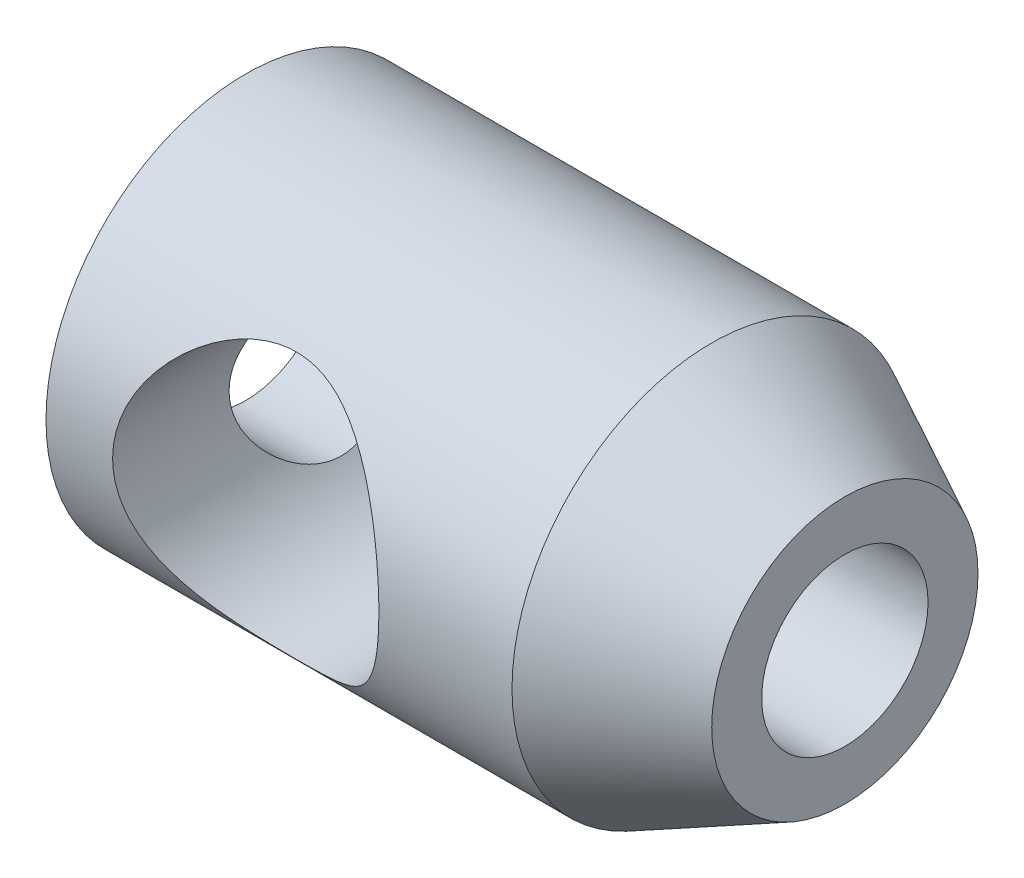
ISO-10303-21;
HEADER;
FILE_DESCRIPTION(('STEP AP214'),'2;1');
FILE_NAME('part.step','',(''),(''),'','','');
FILE_SCHEMA(('AUTOMOTIVE_DESIGN { 1 0 10303 214 1 1 1 1 }'));
ENDSEC;
DATA;
#1=APPLICATION_CONTEXT('core data for automotive mechanical design processes');
#2=APPLICATION_PROTOCOL_DEFINITION('international standard','automotive_design',2000,#1);
#3=PRODUCT_CONTEXT('',#1,'mechanical');
#4=PRODUCT('Part','Part','',(#3));
#5=PRODUCT_RELATED_PRODUCT_CATEGORY('part','',(#4));
#6=PRODUCT_DEFINITION_FORMATION('','',#4);
#7=PRODUCT_DEFINITION_CONTEXT('part definition',#1,'design');
#8=PRODUCT_DEFINITION('design','',#6,#7);
#9=PRODUCT_DEFINITION_SHAPE('','',#8);
#10=(LENGTH_UNIT() NAMED_UNIT(*) SI_UNIT(.MILLI.,.METRE.));
#11=(NAMED_UNIT(*) PLANE_ANGLE_UNIT() SI_UNIT($,.RADIAN.));
#12=(NAMED_UNIT(*) SI_UNIT($,.STERADIAN.) SOLID_ANGLE_UNIT());
#13=UNCERTAINTY_MEASURE_WITH_UNIT(LENGTH_MEASURE(1.E-05),#10,'distance_accuracy_value','');
#14=(GEOMETRIC_REPRESENTATION_CONTEXT(3) GLOBAL_UNCERTAINTY_ASSIGNED_CONTEXT((#13)) GLOBAL_UNIT_ASSIGNED_CONTEXT((#10,
#11,#12)) REPRESENTATION_CONTEXT('',''));
#15=CARTESIAN_POINT('',(0.,0.,0.));
#16=DIRECTION('',(0.,0.,1.));
#17=DIRECTION('',(1.,0.,0.));
#18=AXIS2_PLACEMENT_3D('',#15,#16,#17);
#19=CARTESIAN_POINT('',(18.,0.,0.));
#20=DIRECTION('',(1.,0.,0.));
#21=DIRECTION('',(0.,0.,-1.));
#22=AXIS2_PLACEMENT_3D('',#19,#20,#21);
#23=CYLINDRICAL_SURFACE('',#22,2.49999999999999);
#24=CARTESIAN_POINT('',(2.,0.,-2.49999999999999));
#25=CARTESIAN_POINT('',(2.00000958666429,0.12701747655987,-2.49998952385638));
#26=CARTESIAN_POINT('',(2.0061139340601,0.254191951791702,-2.49025350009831));
#27=CARTESIAN_POINT('',(2.02995624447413,0.504637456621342,-2.45182887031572));
#28=CARTESIAN_POINT('',(2.04771638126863,0.627900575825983,-2.42310413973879));
#29=CARTESIAN_POINT('',(2.09308304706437,0.866410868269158,-2.34837714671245));
#30=CARTESIAN_POINT('',(2.12064081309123,0.981694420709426,-2.30246039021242));
#31=CARTESIAN_POINT('',(2.18330800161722,1.20252080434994,-2.19522833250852));
#32=CARTESIAN_POINT('',(2.2184165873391,1.30806471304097,-2.13391473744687));
#33=CARTESIAN_POINT('',(2.29659695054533,1.51594836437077,-1.9922268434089));
#34=CARTESIAN_POINT('',(2.34008075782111,1.6173591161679,-1.91072139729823));
#35=CARTESIAN_POINT('',(2.42937299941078,1.80597275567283,-1.73356165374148));
#36=CARTESIAN_POINT('',(2.47518450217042,1.89315621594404,-1.63788834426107));
#37=CARTESIAN_POINT('',(2.57139162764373,2.0628574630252,-1.41993221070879));
#38=CARTESIAN_POINT('',(2.62156778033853,2.14314412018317,-1.29580042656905));
#39=CARTESIAN_POINT('',(2.71339603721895,2.28147932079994,-1.03287036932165));
#40=CARTESIAN_POINT('',(2.75506247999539,2.33956541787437,-0.894097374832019));
#41=CARTESIAN_POINT('',(2.81380848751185,2.41866801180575,-0.642378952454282));
#42=CARTESIAN_POINT('',(2.83446188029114,2.44539104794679,-0.532066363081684));
#43=CARTESIAN_POINT('',(2.8643728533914,2.4836368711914,-0.307388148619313));
#44=CARTESIAN_POINT('',(2.87364652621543,2.49518112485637,-0.193028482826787));
#45=CARTESIAN_POINT('',(2.87940228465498,2.50237836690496,0.0368260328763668));
#46=CARTESIAN_POINT('',(2.87585082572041,2.49798968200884,0.15232307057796));
#47=CARTESIAN_POINT('',(2.85645195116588,2.47352633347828,0.380620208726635));
#48=CARTESIAN_POINT('',(2.8405946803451,2.45343909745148,0.493418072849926));
#49=CARTESIAN_POINT('',(2.79934854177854,2.39936209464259,0.710876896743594));
#50=CARTESIAN_POINT('',(2.77418571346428,2.36570043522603,0.815664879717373));
#51=CARTESIAN_POINT('',(2.71708865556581,2.28580369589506,1.01832239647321));
#52=CARTESIAN_POINT('',(2.68515203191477,2.23956416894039,1.11618946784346));
#53=CARTESIAN_POINT('',(2.61090374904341,2.1258983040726,1.32166640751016));
#54=CARTESIAN_POINT('',(2.56776844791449,2.05612773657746,1.42768105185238));
#55=CARTESIAN_POINT('',(2.47988548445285,1.90176111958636,1.6276611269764));
#56=CARTESIAN_POINT('',(2.43513620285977,1.8171498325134,1.72161400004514));
#57=CARTESIAN_POINT('',(2.34040332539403,1.61904732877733,1.91060100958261));
#58=CARTESIAN_POINT('',(2.29077428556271,1.50309447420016,2.0032559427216));
#59=CARTESIAN_POINT('',(2.1994339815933,1.25426444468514,2.16771179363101));
#60=CARTESIAN_POINT('',(2.15771960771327,1.12139395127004,2.23952090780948));
#61=CARTESIAN_POINT('',(2.10564024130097,0.915775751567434,2.32734595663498));
#62=CARTESIAN_POINT('',(2.09033125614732,0.848193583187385,2.35283428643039));
#63=CARTESIAN_POINT('',(2.06298160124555,0.710492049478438,2.39800765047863));
#64=CARTESIAN_POINT('',(2.05093904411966,0.640374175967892,2.41769603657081));
#65=CARTESIAN_POINT('',(2.03050300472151,0.498239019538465,2.45093416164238));
#66=CARTESIAN_POINT('',(2.02210625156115,0.426223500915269,2.46448940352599));
#67=CARTESIAN_POINT('',(2.00921233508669,0.280965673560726,2.48524629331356));
#68=CARTESIAN_POINT('',(2.00471450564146,0.207723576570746,2.4924490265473));
#69=CARTESIAN_POINT('',(1.99806226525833,0.00911917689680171,2.50310930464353));
#70=CARTESIAN_POINT('',(1.999761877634,-0.116782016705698,2.50040036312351));
#71=CARTESIAN_POINT('',(2.01481686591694,-0.365967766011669,2.47624033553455));
#72=CARTESIAN_POINT('',(2.02817144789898,-0.489252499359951,2.45479052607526));
#73=CARTESIAN_POINT('',(2.06452024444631,-0.725036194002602,2.39552141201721));
#74=CARTESIAN_POINT('',(2.08711693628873,-0.837768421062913,2.3583752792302));
#75=CARTESIAN_POINT('',(2.14008597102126,-1.05527816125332,2.26940762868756));
#76=CARTESIAN_POINT('',(2.17045961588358,-1.16005433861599,2.21758365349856));
#77=CARTESIAN_POINT('',(2.24019985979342,-1.37016761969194,2.09496946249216));
#78=CARTESIAN_POINT('',(2.28016473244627,-1.47449380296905,2.02279282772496));
#79=CARTESIAN_POINT('',(2.36386057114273,-1.67028541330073,1.8644123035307));
#80=CARTESIAN_POINT('',(2.40759569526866,-1.76173634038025,1.7781928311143));
#81=CARTESIAN_POINT('',(2.50188261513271,-1.94294835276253,1.57972991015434));
#82=CARTESIAN_POINT('',(2.55250233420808,-2.03053702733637,1.46552558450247));
#83=CARTESIAN_POINT('',(2.64866474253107,-2.18560704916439,1.22224843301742));
#84=CARTESIAN_POINT('',(2.6942109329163,-2.25310231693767,1.09318598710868));
#85=CARTESIAN_POINT('',(2.7653293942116,-2.35369543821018,0.850615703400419));
#86=CARTESIAN_POINT('',(2.79308727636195,-2.39103791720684,0.739518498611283));
#87=CARTESIAN_POINT('',(2.83789938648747,-2.45000216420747,0.511213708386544));
#88=CARTESIAN_POINT('',(2.85497033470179,-2.47164849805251,0.394015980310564));
#89=CARTESIAN_POINT('',(2.87587350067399,-2.49802767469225,0.155819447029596));
#90=CARTESIAN_POINT('',(2.87962996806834,-2.50266374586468,0.034802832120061));
#91=CARTESIAN_POINT('',(2.8730187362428,-2.49439556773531,-0.206261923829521));
#92=CARTESIAN_POINT('',(2.8626463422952,-2.48148548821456,-0.326309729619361));
#93=CARTESIAN_POINT('',(2.8308922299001,-2.44076547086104,-0.552059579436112));
#94=CARTESIAN_POINT('',(2.81046385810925,-2.4142384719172,-0.658138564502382));
#95=CARTESIAN_POINT('',(2.76164937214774,-2.34835238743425,-0.864270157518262));
#96=CARTESIAN_POINT('',(2.7332599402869,-2.30898795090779,-0.964320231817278));
#97=CARTESIAN_POINT('',(2.66672202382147,-2.21205415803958,-1.17119332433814));
#98=CARTESIAN_POINT('',(2.6277557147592,-2.15267427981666,-1.27689994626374));
#99=CARTESIAN_POINT('',(2.54664554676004,-2.01999894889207,-1.47787738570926));
#100=CARTESIAN_POINT('',(2.50449913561,-1.94669224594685,-1.57313966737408));
#101=CARTESIAN_POINT('',(2.41196324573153,-1.7713466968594,-1.77002558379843));
#102=CARTESIAN_POINT('',(2.36159511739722,-1.66649284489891,-1.86916976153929));
#103=CARTESIAN_POINT('',(2.26601946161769,-1.43961937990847,-2.04900159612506));
#104=CARTESIAN_POINT('',(2.22081513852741,-1.31758921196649,-2.12967782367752));
#105=CARTESIAN_POINT('',(2.16040785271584,-1.1234635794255,-2.23456343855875));
#106=CARTESIAN_POINT('',(2.14148165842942,-1.05679601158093,-2.26687480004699));
#107=CARTESIAN_POINT('',(2.10664834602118,-0.92019958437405,-2.32567225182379));
#108=CARTESIAN_POINT('',(2.09073948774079,-0.850272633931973,-2.35216170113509));
#109=CARTESIAN_POINT('',(2.06246625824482,-0.707873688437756,-2.39885714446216));
#110=CARTESIAN_POINT('',(2.05009235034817,-0.635409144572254,-2.41908005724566));
#111=CARTESIAN_POINT('',(2.02924322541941,-0.488456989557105,-2.45297545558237));
#112=CARTESIAN_POINT('',(2.02076513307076,-0.413970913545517,-2.46665277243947));
#113=CARTESIAN_POINT('',(2.00961728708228,-0.28285260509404,-2.48459041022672));
#114=CARTESIAN_POINT('',(2.00601840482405,-0.22650151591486,-2.49036153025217));
#115=CARTESIAN_POINT('',(2.00120754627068,-0.113444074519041,-2.49806878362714));
#116=CARTESIAN_POINT('',(1.99999571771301,-0.0567377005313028,-2.50000467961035));
#117=CARTESIAN_POINT('',(2.,0.,-2.49999999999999));
#118=B_SPLINE_CURVE_WITH_KNOTS('',3,(#24,#25,#26,#27,#28,#29,#30,#31,#32,#33,#34,#35,#36,#37,
#38,#39,#40,#41,#42,#43,#44,#45,#46,#47,#48,#49,#50,#51,#52,#53,#54,#55,#56,#57,#58,#59,#60,#61,
#62,#63,#64,#65,#66,#67,#68,#69,#70,#71,#72,#73,#74,#75,#76,#77,#78,#79,#80,#81,#82,#83,#84,#85,
#86,#87,#88,#89,#90,#91,#92,#93,#94,#95,#96,#97,#98,#99,#100,#101,#102,#103,#104,#105,#106,#107,
#108,#109,#110,#111,#112,#113,#114,#115,#116,#117),.UNSPECIFIED.,.T.,.F.,(4,2,2,2,2,2,2,2,2,2,2,
2,2,2,2,2,2,2,2,2,2,2,2,2,2,2,2,2,2,2,2,2,2,2,2,2,2,2,2,2,2,2,2,2,2,2,4),(0.,0.380824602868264,
0.762375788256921,1.14205397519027,1.52169010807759,1.93164374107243,2.34215256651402,
2.80825951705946,3.2735744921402,3.61824017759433,3.9624178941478,4.30749646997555,
4.65285169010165,4.99031678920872,5.32790135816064,5.72854900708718,6.12961045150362,
6.59684361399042,7.0638928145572,7.28510978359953,7.5061986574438,7.72708876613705,
7.94794112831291,8.32363778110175,8.69930884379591,9.06028425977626,9.42132014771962,
9.81879878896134,10.216721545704,10.6724083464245,11.1277787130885,11.4876929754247,
11.8470427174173,12.2084336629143,12.5699447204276,12.9023575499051,13.2349091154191,
13.6156046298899,13.9966089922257,14.4531049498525,14.9098826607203,15.138984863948,
15.3679545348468,15.5963005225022,15.8244777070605,15.9945785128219,16.1646898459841),.UNSPECIFIED.);
#119=CARTESIAN_POINT('',(2.,0.,-2.49999999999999));
#120=VERTEX_POINT('',#119);
#121=EDGE_CURVE('E30',#120,#120,#118,.T.);
#122=ORIENTED_EDGE('',*,*,#121,.T.);
#123=EDGE_LOOP('',(#122));
#124=FACE_BOUND('',#123,.T.);
#125=CARTESIAN_POINT('',(0.,0.,0.));
#126=DIRECTION('',(1.,0.,0.));
#127=DIRECTION('',(0.,0.,-1.));
#128=AXIS2_PLACEMENT_3D('',#125,#126,#127);
#129=CIRCLE('',#128,2.5);
#130=CARTESIAN_POINT('',(0.,0.,-2.5));
#131=VERTEX_POINT('',#130);
#132=EDGE_CURVE('E99',#131,#131,#129,.T.);
#133=ORIENTED_EDGE('',*,*,#132,.F.);
#134=EDGE_LOOP('',(#133));
#135=FACE_BOUND('',#134,.T.);
#136=ADVANCED_FACE('F26',(#124,#135),#23,.F.);
#137=CARTESIAN_POINT('',(0.,0.,0.));
#138=DIRECTION('',(1.,0.,0.));
#139=DIRECTION('',(0.,0.,-1.));
#140=AXIS2_PLACEMENT_3D('',#137,#138,#139);
#141=PLANE('',#140);
#142=ORIENTED_EDGE('',*,*,#132,.T.);
#143=EDGE_LOOP('',(#142));
#144=FACE_BOUND('',#143,.T.);
#145=CARTESIAN_POINT('',(0.,0.,0.));
#146=DIRECTION('',(-1.,0.,0.));
#147=DIRECTION('',(0.,0.,1.));
#148=AXIS2_PLACEMENT_3D('',#145,#146,#147);
#149=CIRCLE('',#148,6.);
#150=CARTESIAN_POINT('',(0.,0.,6.));
#151=VERTEX_POINT('',#150);
#152=EDGE_CURVE('E10',#151,#151,#149,.T.);
#153=ORIENTED_EDGE('',*,*,#152,.T.);
#154=EDGE_LOOP('',(#153));
#155=FACE_BOUND('',#154,.T.);
#156=ADVANCED_FACE('F28',(#144,#155),#141,.F.);
#157=CARTESIAN_POINT('',(-27.94,0.,0.));
#158=DIRECTION('',(-1.,0.,0.));
#159=DIRECTION('',(0.,0.,1.));
#160=AXIS2_PLACEMENT_3D('',#157,#158,#159);
#161=CYLINDRICAL_SURFACE('',#160,6.);
#162=CARTESIAN_POINT('',(10.,0.,6.));
#163=CARTESIAN_POINT('',(9.99999731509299,-0.200961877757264,5.9999978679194));
#164=CARTESIAN_POINT('',(9.98477111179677,-0.401936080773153,5.9898153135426));
#165=CARTESIAN_POINT('',(9.92480722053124,-0.79746821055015,5.95009379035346));
#166=CARTESIAN_POINT('',(9.8800555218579,-0.992023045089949,5.92054563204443));
#167=CARTESIAN_POINT('',(9.7637845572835,-1.36842380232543,5.84500964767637));
#168=CARTESIAN_POINT('',(9.69239062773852,-1.55032457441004,5.79909884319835));
#169=CARTESIAN_POINT('',(9.52587236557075,-1.89883175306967,5.69452202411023));
#170=CARTESIAN_POINT('',(9.43074458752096,-2.06543593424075,5.63585415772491));
#171=CARTESIAN_POINT('',(9.21069007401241,-2.3945652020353,5.50454977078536));
#172=CARTESIAN_POINT('',(9.08391967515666,-2.55554447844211,5.43115036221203));
#173=CARTESIAN_POINT('',(8.80852448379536,-2.85547224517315,5.27963383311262));
#174=CARTESIAN_POINT('',(8.65986838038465,-2.994388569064,5.20151004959));
#175=CARTESIAN_POINT('',(8.40961614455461,-3.19492879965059,5.07935723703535));
#176=CARTESIAN_POINT('',(8.31452998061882,-3.26448421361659,5.03481061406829));
#177=CARTESIAN_POINT('',(8.11801704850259,-3.39528506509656,4.9475474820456));
#178=CARTESIAN_POINT('',(8.01658884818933,-3.45652861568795,4.90483139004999));
#179=CARTESIAN_POINT('',(7.70342381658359,-3.62693348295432,4.78172496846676));
#180=CARTESIAN_POINT('',(7.48230114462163,-3.72317686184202,4.70611539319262));
#181=CARTESIAN_POINT('',(7.0865532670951,-3.85349251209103,4.59951859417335));
#182=CARTESIAN_POINT('',(6.91693662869,-3.89749210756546,4.56195075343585));
#183=CARTESIAN_POINT('',(6.57051744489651,-3.96300919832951,4.5051611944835));
#184=CARTESIAN_POINT('',(6.39372783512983,-3.98456544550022,4.48590785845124));
#185=CARTESIAN_POINT('',(6.03704870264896,-4.0038281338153,4.46873162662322));
#186=CARTESIAN_POINT('',(5.85714948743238,-4.00143708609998,4.47089592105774));
#187=CARTESIAN_POINT('',(5.50073051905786,-3.97275139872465,4.49639563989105));
#188=CARTESIAN_POINT('',(5.32421375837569,-3.94643650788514,4.51974900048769));
#189=CARTESIAN_POINT('',(4.98706578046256,-3.8732999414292,4.58254368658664));
#190=CARTESIAN_POINT('',(4.82607729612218,-3.82743424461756,4.62122975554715));
#191=CARTESIAN_POINT('',(4.51395264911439,-3.71740235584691,4.71019246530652));
#192=CARTESIAN_POINT('',(4.36281974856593,-3.65323014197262,4.76047291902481));
#193=CARTESIAN_POINT('',(4.04194919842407,-3.49347638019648,4.87928392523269));
#194=CARTESIAN_POINT('',(3.87468019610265,-3.3941610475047,4.94944635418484));
#195=CARTESIAN_POINT('',(3.5572332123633,-3.17337920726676,5.09383075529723));
#196=CARTESIAN_POINT('',(3.40707668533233,-3.05188537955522,5.16805765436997));
#197=CARTESIAN_POINT('',(3.09491490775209,-2.75962330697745,5.33086687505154));
#198=CARTESIAN_POINT('',(2.93733190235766,-2.58387876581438,5.41909489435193));
#199=CARTESIAN_POINT('',(2.65360701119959,-2.20401599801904,5.58436201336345));
#200=CARTESIAN_POINT('',(2.52743570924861,-1.99992459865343,5.6614115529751));
#201=CARTESIAN_POINT('',(2.33304456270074,-1.60971565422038,5.78290808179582));
#202=CARTESIAN_POINT('',(2.25831327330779,-1.42791528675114,5.83078522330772));
#203=CARTESIAN_POINT('',(2.13579014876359,-1.05207208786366,5.91015438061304));
#204=CARTESIAN_POINT('',(2.08797554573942,-0.858039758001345,5.94166024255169));
#205=CARTESIAN_POINT('',(2.02167766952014,-0.46197090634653,5.98551764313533));
#206=CARTESIAN_POINT('',(2.00332107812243,-0.259903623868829,5.9977864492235));
#207=CARTESIAN_POINT('',(1.99750582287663,0.1448830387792,6.00166229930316));
#208=CARTESIAN_POINT('',(2.01004499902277,0.347602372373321,5.99327078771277));
#209=CARTESIAN_POINT('',(2.06324811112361,0.732911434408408,5.95799178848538));
#210=CARTESIAN_POINT('',(2.10187459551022,0.915914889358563,5.93244492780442));
#211=CARTESIAN_POINT('',(2.20319137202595,1.27223278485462,5.86636898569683));
#212=CARTESIAN_POINT('',(2.26588550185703,1.44554567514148,5.82583751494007));
#213=CARTESIAN_POINT('',(2.41730459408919,1.78932950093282,5.72992705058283));
#214=CARTESIAN_POINT('',(2.50737630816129,1.95899236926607,5.6737974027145));
#215=CARTESIAN_POINT('',(2.70886657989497,2.28136604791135,5.55203711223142));
#216=CARTESIAN_POINT('',(2.82029832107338,2.4340662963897,5.48640060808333));
#217=CARTESIAN_POINT('',(3.08121573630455,2.7437089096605,5.33909093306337));
#218=CARTESIAN_POINT('',(3.23393252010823,2.89750375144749,5.25652313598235));
#219=CARTESIAN_POINT('',(3.5622228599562,3.17867936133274,5.09142346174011));
#220=CARTESIAN_POINT('',(3.73781207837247,3.30604187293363,5.00889164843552));
#221=CARTESIAN_POINT('',(4.09428482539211,3.52249553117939,4.85879357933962));
#222=CARTESIAN_POINT('',(4.27346406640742,3.61391272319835,4.79055194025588));
#223=CARTESIAN_POINT('',(4.64774530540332,3.76992427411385,4.66877948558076));
#224=CARTESIAN_POINT('',(4.842817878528,3.83456691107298,4.61522225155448));
#225=CARTESIAN_POINT('',(5.20912897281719,3.9247168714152,4.53866416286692));
#226=CARTESIAN_POINT('',(5.37834361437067,3.95517195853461,4.51189995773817));
#227=CARTESIAN_POINT('',(5.72114656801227,3.99398411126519,4.477589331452));
#228=CARTESIAN_POINT('',(5.89472992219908,4.00236517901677,4.47002203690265));
#229=CARTESIAN_POINT('',(6.24128609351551,3.99647846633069,4.47528401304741));
#230=CARTESIAN_POINT('',(6.41425848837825,3.98219727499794,4.48812536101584));
#231=CARTESIAN_POINT('',(6.75468713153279,3.93193984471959,4.53220908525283));
#232=CARTESIAN_POINT('',(6.92213570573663,3.89593466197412,4.56347600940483));
#233=CARTESIAN_POINT('',(7.29142202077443,3.7918611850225,4.65053670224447));
#234=CARTESIAN_POINT('',(7.49053394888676,3.71780572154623,4.71064593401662));
#235=CARTESIAN_POINT('',(7.87097514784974,3.5416885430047,4.8444439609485));
#236=CARTESIAN_POINT('',(8.05227896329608,3.43958750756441,4.91815177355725));
#237=CARTESIAN_POINT('',(8.39855810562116,3.20797320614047,5.07234090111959));
#238=CARTESIAN_POINT('',(8.56317614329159,3.07799480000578,5.1529210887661));
#239=CARTESIAN_POINT('',(8.87066631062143,2.79340674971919,5.3125766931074));
#240=CARTESIAN_POINT('',(9.01353175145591,2.63878955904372,5.39165164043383));
#241=CARTESIAN_POINT('',(9.21879506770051,2.37780795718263,5.50971336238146));
#242=CARTESIAN_POINT('',(9.2894836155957,2.27907205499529,5.55138661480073));
#243=CARTESIAN_POINT('',(9.42215785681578,2.07453205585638,5.63101613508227));
#244=CARTESIAN_POINT('',(9.48414754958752,1.96873124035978,5.66897410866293));
#245=CARTESIAN_POINT('',(9.59864385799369,1.75068617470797,5.74005451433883));
#246=CARTESIAN_POINT('',(9.65115927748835,1.63844803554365,5.77318143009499));
#247=CARTESIAN_POINT('',(9.74596123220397,1.40828926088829,5.83360071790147));
#248=CARTESIAN_POINT('',(9.78825135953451,1.29037063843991,5.86089513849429));
#249=CARTESIAN_POINT('',(9.88225688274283,0.982973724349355,5.92199193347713));
#250=CARTESIAN_POINT('',(9.92620807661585,0.790052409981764,5.95101863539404));
#251=CARTESIAN_POINT('',(9.98507005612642,0.398088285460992,5.99001656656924));
#252=CARTESIAN_POINT('',(10.0000026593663,0.199050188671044,6.00000211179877));
#253=CARTESIAN_POINT('',(10.,0.,6.));
#254=B_SPLINE_CURVE_WITH_KNOTS('',3,(#162,#163,#164,#165,#166,#167,#168,#169,#170,#171,#172,
#173,#174,#175,#176,#177,#178,#179,#180,#181,#182,#183,#184,#185,#186,#187,#188,#189,#190,#191,
#192,#193,#194,#195,#196,#197,#198,#199,#200,#201,#202,#203,#204,#205,#206,#207,#208,#209,#210,
#211,#212,#213,#214,#215,#216,#217,#218,#219,#220,#221,#222,#223,#224,#225,#226,#227,#228,#229,
#230,#231,#232,#233,#234,#235,#236,#237,#238,#239,#240,#241,#242,#243,#244,#245,#246,#247,#248,
#249,#250,#251,#252,#253),.UNSPECIFIED.,.T.,.F.,(4,2,2,2,2,2,2,2,2,2,2,2,2,2,2,2,2,2,2,2,2,2,2,
2,2,2,2,2,2,2,2,2,2,2,2,2,2,2,2,2,2,2,2,2,2,4),(0.,0.602106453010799,1.20449882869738,
1.80409230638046,2.40377287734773,3.05434058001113,3.70584823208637,4.08328599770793,
4.46080930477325,5.21378174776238,5.74934951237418,6.28399099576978,6.82080987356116,
7.35808358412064,7.87165288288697,8.38539131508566,9.00362713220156,9.62262971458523,
10.3750547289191,11.1267724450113,11.7311573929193,12.3350303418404,12.9414933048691,
13.5479138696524,14.1117373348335,14.6756507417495,15.2737225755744,15.8721647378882,
16.5652391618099,17.2587907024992,17.8936743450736,18.5274081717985,19.0471565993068,
19.5663396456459,20.085830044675,20.6060141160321,21.2648078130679,21.9245299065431,
22.5962605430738,23.2681973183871,23.6528866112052,24.0373984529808,24.4215511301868,
24.8055686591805,25.4023963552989,25.9987751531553),.UNSPECIFIED.);
#255=CARTESIAN_POINT('',(10.,0.,6.));
#256=VERTEX_POINT('',#255);
#257=EDGE_CURVE('E66',#256,#256,#254,.T.);
#258=ORIENTED_EDGE('',*,*,#257,.T.);
#259=EDGE_LOOP('',(#258));
#260=FACE_BOUND('',#259,.T.);
#261=CARTESIAN_POINT('',(10.,0.,-6.));
#262=CARTESIAN_POINT('',(9.999997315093,0.200961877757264,-5.9999978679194));
#263=CARTESIAN_POINT('',(9.98477111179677,0.401936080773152,-5.9898153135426));
#264=CARTESIAN_POINT('',(9.92480722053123,0.79746821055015,-5.95009379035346));
#265=CARTESIAN_POINT('',(9.8800555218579,0.992023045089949,-5.92054563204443));
#266=CARTESIAN_POINT('',(9.7637845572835,1.36842380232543,-5.84500964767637));
#267=CARTESIAN_POINT('',(9.69239062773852,1.55032457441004,-5.79909884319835));
#268=CARTESIAN_POINT('',(9.52587236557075,1.89883175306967,-5.69452202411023));
#269=CARTESIAN_POINT('',(9.43074458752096,2.06543593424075,-5.63585415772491));
#270=CARTESIAN_POINT('',(9.21069007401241,2.3945652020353,-5.50454977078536));
#271=CARTESIAN_POINT('',(9.08391967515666,2.55554447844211,-5.43115036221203));
#272=CARTESIAN_POINT('',(8.80852448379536,2.85547224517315,-5.27963383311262));
#273=CARTESIAN_POINT('',(8.65986838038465,2.994388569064,-5.20151004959));
#274=CARTESIAN_POINT('',(8.40961614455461,3.19492879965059,-5.07935723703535));
#275=CARTESIAN_POINT('',(8.31452998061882,3.26448421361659,-5.03481061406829));
#276=CARTESIAN_POINT('',(8.11801704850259,3.39528506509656,-4.9475474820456));
#277=CARTESIAN_POINT('',(8.01658884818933,3.45652861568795,-4.90483139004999));
#278=CARTESIAN_POINT('',(7.70342381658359,3.62693348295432,-4.78172496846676));
#279=CARTESIAN_POINT('',(7.48230114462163,3.72317686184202,-4.70611539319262));
#280=CARTESIAN_POINT('',(7.0865532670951,3.85349251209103,-4.59951859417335));
#281=CARTESIAN_POINT('',(6.91693662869,3.89749210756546,-4.56195075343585));
#282=CARTESIAN_POINT('',(6.57051744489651,3.96300919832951,-4.5051611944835));
#283=CARTESIAN_POINT('',(6.39372783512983,3.98456544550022,-4.48590785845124));
#284=CARTESIAN_POINT('',(6.03704870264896,4.0038281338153,-4.46873162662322));
#285=CARTESIAN_POINT('',(5.85714948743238,4.00143708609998,-4.47089592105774));
#286=CARTESIAN_POINT('',(5.50073051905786,3.97275139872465,-4.49639563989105));
#287=CARTESIAN_POINT('',(5.32421375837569,3.94643650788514,-4.51974900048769));
#288=CARTESIAN_POINT('',(4.98706578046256,3.8732999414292,-4.58254368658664));
#289=CARTESIAN_POINT('',(4.82607729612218,3.82743424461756,-4.62122975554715));
#290=CARTESIAN_POINT('',(4.51395264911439,3.71740235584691,-4.71019246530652));
#291=CARTESIAN_POINT('',(4.36281974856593,3.65323014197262,-4.76047291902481));
#292=CARTESIAN_POINT('',(4.04194919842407,3.49347638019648,-4.87928392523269));
#293=CARTESIAN_POINT('',(3.87468019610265,3.3941610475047,-4.94944635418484));
#294=CARTESIAN_POINT('',(3.5572332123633,3.17337920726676,-5.09383075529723));
#295=CARTESIAN_POINT('',(3.40707668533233,3.05188537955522,-5.16805765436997));
#296=CARTESIAN_POINT('',(3.09491490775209,2.75962330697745,-5.33086687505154));
#297=CARTESIAN_POINT('',(2.93733190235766,2.58387876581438,-5.41909489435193));
#298=CARTESIAN_POINT('',(2.65360701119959,2.20401599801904,-5.58436201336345));
#299=CARTESIAN_POINT('',(2.52743570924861,1.99992459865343,-5.6614115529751));
#300=CARTESIAN_POINT('',(2.33304456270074,1.60971565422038,-5.78290808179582));
#301=CARTESIAN_POINT('',(2.25831327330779,1.42791528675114,-5.83078522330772));
#302=CARTESIAN_POINT('',(2.13579014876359,1.05207208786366,-5.91015438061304));
#303=CARTESIAN_POINT('',(2.08797554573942,0.858039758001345,-5.94166024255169));
#304=CARTESIAN_POINT('',(2.02167766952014,0.46197090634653,-5.98551764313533));
#305=CARTESIAN_POINT('',(2.00332107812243,0.259903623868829,-5.9977864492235));
#306=CARTESIAN_POINT('',(1.99750582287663,-0.1448830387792,-6.00166229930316));
#307=CARTESIAN_POINT('',(2.01004499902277,-0.347602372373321,-5.99327078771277));
#308=CARTESIAN_POINT('',(2.06324811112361,-0.732911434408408,-5.95799178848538));
#309=CARTESIAN_POINT('',(2.10187459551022,-0.915914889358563,-5.93244492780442));
#310=CARTESIAN_POINT('',(2.20319137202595,-1.27223278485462,-5.86636898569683));
#311=CARTESIAN_POINT('',(2.26588550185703,-1.44554567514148,-5.82583751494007));
#312=CARTESIAN_POINT('',(2.41730459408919,-1.78932950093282,-5.72992705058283));
#313=CARTESIAN_POINT('',(2.50737630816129,-1.95899236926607,-5.6737974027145));
#314=CARTESIAN_POINT('',(2.70886657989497,-2.28136604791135,-5.55203711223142));
#315=CARTESIAN_POINT('',(2.82029832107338,-2.4340662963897,-5.48640060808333));
#316=CARTESIAN_POINT('',(3.08121573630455,-2.7437089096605,-5.33909093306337));
#317=CARTESIAN_POINT('',(3.23393252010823,-2.89750375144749,-5.25652313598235));
#318=CARTESIAN_POINT('',(3.5622228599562,-3.17867936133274,-5.09142346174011));
#319=CARTESIAN_POINT('',(3.73781207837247,-3.30604187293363,-5.00889164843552));
#320=CARTESIAN_POINT('',(4.09428482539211,-3.52249553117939,-4.85879357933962));
#321=CARTESIAN_POINT('',(4.27346406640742,-3.61391272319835,-4.79055194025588));
#322=CARTESIAN_POINT('',(4.64774530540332,-3.76992427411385,-4.66877948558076));
#323=CARTESIAN_POINT('',(4.842817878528,-3.83456691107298,-4.61522225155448));
#324=CARTESIAN_POINT('',(5.20912897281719,-3.9247168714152,-4.53866416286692));
#325=CARTESIAN_POINT('',(5.37834361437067,-3.95517195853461,-4.51189995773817));
#326=CARTESIAN_POINT('',(5.72114656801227,-3.99398411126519,-4.477589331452));
#327=CARTESIAN_POINT('',(5.89472992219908,-4.00236517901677,-4.47002203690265));
#328=CARTESIAN_POINT('',(6.24128609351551,-3.99647846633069,-4.47528401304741));
#329=CARTESIAN_POINT('',(6.41425848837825,-3.98219727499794,-4.48812536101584));
#330=CARTESIAN_POINT('',(6.75468713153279,-3.93193984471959,-4.53220908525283));
#331=CARTESIAN_POINT('',(6.92213570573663,-3.89593466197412,-4.56347600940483));
#332=CARTESIAN_POINT('',(7.29142202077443,-3.7918611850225,-4.65053670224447));
#333=CARTESIAN_POINT('',(7.49053394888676,-3.71780572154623,-4.71064593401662));
#334=CARTESIAN_POINT('',(7.87097514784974,-3.5416885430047,-4.8444439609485));
#335=CARTESIAN_POINT('',(8.05227896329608,-3.43958750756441,-4.91815177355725));
#336=CARTESIAN_POINT('',(8.39855810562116,-3.20797320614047,-5.07234090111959));
#337=CARTESIAN_POINT('',(8.56317614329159,-3.07799480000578,-5.1529210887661));
#338=CARTESIAN_POINT('',(8.87066631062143,-2.79340674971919,-5.3125766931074));
#339=CARTESIAN_POINT('',(9.01353175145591,-2.63878955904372,-5.39165164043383));
#340=CARTESIAN_POINT('',(9.21879506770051,-2.37780795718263,-5.50971336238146));
#341=CARTESIAN_POINT('',(9.2894836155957,-2.27907205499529,-5.55138661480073));
#342=CARTESIAN_POINT('',(9.42215785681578,-2.07453205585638,-5.63101613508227));
#343=CARTESIAN_POINT('',(9.48414754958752,-1.96873124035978,-5.66897410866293));
#344=CARTESIAN_POINT('',(9.59864385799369,-1.75068617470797,-5.74005451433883));
#345=CARTESIAN_POINT('',(9.65115927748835,-1.63844803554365,-5.77318143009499));
#346=CARTESIAN_POINT('',(9.74596123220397,-1.40828926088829,-5.83360071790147));
#347=CARTESIAN_POINT('',(9.78825135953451,-1.29037063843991,-5.86089513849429));
#348=CARTESIAN_POINT('',(9.88225688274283,-0.982973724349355,-5.92199193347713));
#349=CARTESIAN_POINT('',(9.92620807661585,-0.790052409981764,-5.95101863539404));
#350=CARTESIAN_POINT('',(9.98507005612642,-0.398088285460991,-5.99001656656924));
#351=CARTESIAN_POINT('',(10.0000026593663,-0.199050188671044,-6.00000211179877));
#352=CARTESIAN_POINT('',(10.,0.,-6.));
#353=B_SPLINE_CURVE_WITH_KNOTS('',3,(#261,#262,#263,#264,#265,#266,#267,#268,#269,#270,#271,
#272,#273,#274,#275,#276,#277,#278,#279,#280,#281,#282,#283,#284,#285,#286,#287,#288,#289,#290,
#291,#292,#293,#294,#295,#296,#297,#298,#299,#300,#301,#302,#303,#304,#305,#306,#307,#308,#309,
#310,#311,#312,#313,#314,#315,#316,#317,#318,#319,#320,#321,#322,#323,#324,#325,#326,#327,#328,
#329,#330,#331,#332,#333,#334,#335,#336,#337,#338,#339,#340,#341,#342,#343,#344,#345,#346,#347,
#348,#349,#350,#351,#352),.UNSPECIFIED.,.T.,.F.,(4,2,2,2,2,2,2,2,2,2,2,2,2,2,2,2,2,2,2,2,2,2,2,
2,2,2,2,2,2,2,2,2,2,2,2,2,2,2,2,2,2,2,2,2,2,4),(0.,0.602106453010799,1.20449882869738,
1.80409230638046,2.40377287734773,3.05434058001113,3.70584823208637,4.08328599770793,
4.46080930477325,5.21378174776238,5.74934951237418,6.28399099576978,6.82080987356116,
7.35808358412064,7.87165288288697,8.38539131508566,9.00362713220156,9.62262971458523,
10.3750547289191,11.1267724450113,11.7311573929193,12.3350303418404,12.9414933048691,
13.5479138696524,14.1117373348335,14.6756507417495,15.2737225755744,15.8721647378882,
16.5652391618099,17.2587907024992,17.8936743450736,18.5274081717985,19.0471565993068,
19.5663396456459,20.085830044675,20.6060141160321,21.2648078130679,21.9245299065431,
22.5962605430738,23.2681973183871,23.6528866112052,24.0373984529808,24.4215511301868,
24.8055686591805,25.4023963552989,25.9987751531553),.UNSPECIFIED.);
#354=CARTESIAN_POINT('',(10.,0.,-6.));
#355=VERTEX_POINT('',#354);
#356=EDGE_CURVE('E62',#355,#355,#353,.T.);
#357=ORIENTED_EDGE('',*,*,#356,.T.);
#358=EDGE_LOOP('',(#357));
#359=FACE_BOUND('',#358,.T.);
#360=ORIENTED_EDGE('',*,*,#152,.F.);
#361=EDGE_LOOP('',(#360));
#362=FACE_BOUND('',#361,.T.);
#363=CARTESIAN_POINT('',(14.,0.,0.));
#364=DIRECTION('',(-1.,0.,0.));
#365=DIRECTION('',(0.,0.,1.));
#366=AXIS2_PLACEMENT_3D('',#363,#364,#365);
#367=CIRCLE('',#366,6.);
#368=CARTESIAN_POINT('',(14.,0.,6.));
#369=VERTEX_POINT('',#368);
#370=EDGE_CURVE('E38',#369,#369,#367,.T.);
#371=ORIENTED_EDGE('',*,*,#370,.T.);
#372=EDGE_LOOP('',(#371));
#373=FACE_BOUND('',#372,.T.);
#374=ADVANCED_FACE('F70',(#260,#359,#362,#373),#161,.T.);
#375=CARTESIAN_POINT('',(18.,0.,0.));
#376=DIRECTION('',(-1.,0.,0.));
#377=DIRECTION('',(0.,0.,1.));
#378=AXIS2_PLACEMENT_3D('',#375,#376,#377);
#379=CONICAL_SURFACE('',#378,4.,0.463647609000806);
#380=ORIENTED_EDGE('',*,*,#370,.F.);
#381=EDGE_LOOP('',(#380));
#382=FACE_BOUND('',#381,.T.);
#383=CARTESIAN_POINT('',(18.,0.,0.));
#384=DIRECTION('',(-1.,0.,0.));
#385=DIRECTION('',(0.,0.,1.));
#386=AXIS2_PLACEMENT_3D('',#383,#384,#385);
#387=CIRCLE('',#386,4.);
#388=CARTESIAN_POINT('',(18.,0.,4.));
#389=VERTEX_POINT('',#388);
#390=EDGE_CURVE('E43',#389,#389,#387,.T.);
#391=ORIENTED_EDGE('',*,*,#390,.T.);
#392=EDGE_LOOP('',(#391));
#393=FACE_BOUND('',#392,.T.);
#394=ADVANCED_FACE('F74',(#382,#393),#379,.T.);
#395=CARTESIAN_POINT('',(18.,4.,0.));
#396=DIRECTION('',(-1.,0.,0.));
#397=DIRECTION('',(0.,0.,1.));
#398=AXIS2_PLACEMENT_3D('',#395,#396,#397);
#399=PLANE('',#398);
#400=CARTESIAN_POINT('',(18.,0.,0.));
#401=DIRECTION('',(1.,0.,0.));
#402=DIRECTION('',(0.,0.,-1.));
#403=AXIS2_PLACEMENT_3D('',#400,#401,#402);
#404=CIRCLE('',#403,2.49999999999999);
#405=CARTESIAN_POINT('',(18.,0.,-2.49999999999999));
#406=VERTEX_POINT('',#405);
#407=EDGE_CURVE('E100',#406,#406,#404,.T.);
#408=ORIENTED_EDGE('',*,*,#407,.F.);
#409=EDGE_LOOP('',(#408));
#410=FACE_BOUND('',#409,.T.);
#411=ORIENTED_EDGE('',*,*,#390,.F.);
#412=EDGE_LOOP('',(#411));
#413=FACE_BOUND('',#412,.T.);
#414=ADVANCED_FACE('F78',(#410,#413),#399,.F.);
#415=CARTESIAN_POINT('',(10.,0.,-2.49999999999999));
#416=CARTESIAN_POINT('',(9.99999041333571,-0.12701747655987,-2.49998952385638));
#417=CARTESIAN_POINT('',(9.9938860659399,-0.254191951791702,-2.49025350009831));
#418=CARTESIAN_POINT('',(9.97004375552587,-0.504637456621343,-2.45182887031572));
#419=CARTESIAN_POINT('',(9.95228361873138,-0.627900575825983,-2.42310413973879));
#420=CARTESIAN_POINT('',(9.90691695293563,-0.866410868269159,-2.34837714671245));
#421=CARTESIAN_POINT('',(9.87935918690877,-0.981694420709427,-2.30246039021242));
#422=CARTESIAN_POINT('',(9.81669199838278,-1.20252080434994,-2.19522833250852));
#423=CARTESIAN_POINT('',(9.7815834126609,-1.30806471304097,-2.13391473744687));
#424=CARTESIAN_POINT('',(9.70340304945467,-1.51594836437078,-1.9922268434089));
#425=CARTESIAN_POINT('',(9.65991924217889,-1.6173591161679,-1.91072139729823));
#426=CARTESIAN_POINT('',(9.57062700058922,-1.80597275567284,-1.73356165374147));
#427=CARTESIAN_POINT('',(9.52481549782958,-1.89315621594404,-1.63788834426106));
#428=CARTESIAN_POINT('',(9.42860837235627,-2.0628574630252,-1.41993221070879));
#429=CARTESIAN_POINT('',(9.37843221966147,-2.14314412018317,-1.29580042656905));
#430=CARTESIAN_POINT('',(9.28660396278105,-2.28147932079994,-1.03287036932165));
#431=CARTESIAN_POINT('',(9.24493752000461,-2.33956541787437,-0.894097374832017));
#432=CARTESIAN_POINT('',(9.18619151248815,-2.41866801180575,-0.64237895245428));
#433=CARTESIAN_POINT('',(9.16553811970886,-2.44539104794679,-0.532066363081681));
#434=CARTESIAN_POINT('',(9.1356271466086,-2.4836368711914,-0.307388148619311));
#435=CARTESIAN_POINT('',(9.12635347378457,-2.49518112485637,-0.193028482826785));
#436=CARTESIAN_POINT('',(9.12059771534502,-2.50237836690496,0.0368260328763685));
#437=CARTESIAN_POINT('',(9.12414917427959,-2.49798968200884,0.152323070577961));
#438=CARTESIAN_POINT('',(9.14354804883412,-2.47352633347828,0.380620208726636));
#439=CARTESIAN_POINT('',(9.1594053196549,-2.45343909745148,0.493418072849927));
#440=CARTESIAN_POINT('',(9.20065145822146,-2.39936209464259,0.710876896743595));
#441=CARTESIAN_POINT('',(9.22581428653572,-2.36570043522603,0.815664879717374));
#442=CARTESIAN_POINT('',(9.28291134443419,-2.28580369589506,1.01832239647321));
#443=CARTESIAN_POINT('',(9.31484796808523,-2.23956416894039,1.11618946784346));
#444=CARTESIAN_POINT('',(9.38909625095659,-2.1258983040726,1.32166640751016));
#445=CARTESIAN_POINT('',(9.43223155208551,-2.05612773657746,1.42768105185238));
#446=CARTESIAN_POINT('',(9.52011451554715,-1.90176111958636,1.6276611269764));
#447=CARTESIAN_POINT('',(9.56486379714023,-1.8171498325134,1.72161400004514));
#448=CARTESIAN_POINT('',(9.65959667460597,-1.61904732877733,1.91060100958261));
#449=CARTESIAN_POINT('',(9.70922571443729,-1.50309447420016,2.0032559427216));
#450=CARTESIAN_POINT('',(9.8005660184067,-1.25426444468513,2.16771179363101));
#451=CARTESIAN_POINT('',(9.84228039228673,-1.12139395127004,2.23952090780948));
#452=CARTESIAN_POINT('',(9.89435975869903,-0.915775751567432,2.32734595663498));
#453=CARTESIAN_POINT('',(9.90966874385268,-0.848193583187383,2.35283428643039));
#454=CARTESIAN_POINT('',(9.93701839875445,-0.710492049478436,2.39800765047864));
#455=CARTESIAN_POINT('',(9.94906095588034,-0.640374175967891,2.41769603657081));
#456=CARTESIAN_POINT('',(9.9694969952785,-0.498239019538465,2.45093416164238));
#457=CARTESIAN_POINT('',(9.97789374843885,-0.426223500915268,2.46448940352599));
#458=CARTESIAN_POINT('',(9.99078766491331,-0.280965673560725,2.48524629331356));
#459=CARTESIAN_POINT('',(9.99528549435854,-0.207723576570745,2.4924490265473));
#460=CARTESIAN_POINT('',(10.0019377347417,-0.00911917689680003,2.50310930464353));
#461=CARTESIAN_POINT('',(10.000238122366,0.1167820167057,2.50040036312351));
#462=CARTESIAN_POINT('',(9.98518313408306,0.365967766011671,2.47624033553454));
#463=CARTESIAN_POINT('',(9.97182855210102,0.489252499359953,2.45479052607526));
#464=CARTESIAN_POINT('',(9.9354797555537,0.725036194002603,2.39552141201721));
#465=CARTESIAN_POINT('',(9.91288306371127,0.837768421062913,2.3583752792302));
#466=CARTESIAN_POINT('',(9.85991402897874,1.05527816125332,2.26940762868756));
#467=CARTESIAN_POINT('',(9.82954038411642,1.16005433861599,2.21758365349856));
#468=CARTESIAN_POINT('',(9.75980014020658,1.37016761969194,2.09496946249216));
#469=CARTESIAN_POINT('',(9.71983526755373,1.47449380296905,2.02279282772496));
#470=CARTESIAN_POINT('',(9.63613942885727,1.67028541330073,1.8644123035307));
#471=CARTESIAN_POINT('',(9.59240430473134,1.76173634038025,1.7781928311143));
#472=CARTESIAN_POINT('',(9.49811738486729,1.94294835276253,1.57972991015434));
#473=CARTESIAN_POINT('',(9.44749766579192,2.03053702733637,1.46552558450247));
#474=CARTESIAN_POINT('',(9.35133525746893,2.18560704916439,1.22224843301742));
#475=CARTESIAN_POINT('',(9.3057890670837,2.25310231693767,1.09318598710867));
#476=CARTESIAN_POINT('',(9.2346706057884,2.35369543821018,0.850615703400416));
#477=CARTESIAN_POINT('',(9.20691272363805,2.39103791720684,0.739518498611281));
#478=CARTESIAN_POINT('',(9.16210061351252,2.45000216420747,0.511213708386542));
#479=CARTESIAN_POINT('',(9.14502966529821,2.47164849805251,0.394015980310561));
#480=CARTESIAN_POINT('',(9.12412649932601,2.49802767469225,0.155819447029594));
#481=CARTESIAN_POINT('',(9.12037003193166,2.50266374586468,0.0348028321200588));
#482=CARTESIAN_POINT('',(9.1269812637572,2.49439556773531,-0.206261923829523));
#483=CARTESIAN_POINT('',(9.1373536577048,2.48148548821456,-0.326309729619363));
#484=CARTESIAN_POINT('',(9.1691077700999,2.44076547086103,-0.552059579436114));
#485=CARTESIAN_POINT('',(9.18953614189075,2.4142384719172,-0.658138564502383));
#486=CARTESIAN_POINT('',(9.23835062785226,2.34835238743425,-0.864270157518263));
#487=CARTESIAN_POINT('',(9.2667400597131,2.30898795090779,-0.964320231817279));
#488=CARTESIAN_POINT('',(9.33327797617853,2.21205415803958,-1.17119332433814));
#489=CARTESIAN_POINT('',(9.37224428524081,2.15267427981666,-1.27689994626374));
#490=CARTESIAN_POINT('',(9.45335445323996,2.01999894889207,-1.47787738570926));
#491=CARTESIAN_POINT('',(9.49550086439,1.94669224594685,-1.57313966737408));
#492=CARTESIAN_POINT('',(9.58803675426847,1.7713466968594,-1.77002558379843));
#493=CARTESIAN_POINT('',(9.63840488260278,1.66649284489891,-1.86916976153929));
#494=CARTESIAN_POINT('',(9.73398053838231,1.43961937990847,-2.04900159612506));
#495=CARTESIAN_POINT('',(9.77918486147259,1.31758921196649,-2.12967782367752));
#496=CARTESIAN_POINT('',(9.83959214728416,1.12346357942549,-2.23456343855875));
#497=CARTESIAN_POINT('',(9.85851834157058,1.05679601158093,-2.26687480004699));
#498=CARTESIAN_POINT('',(9.89335165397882,0.920199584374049,-2.32567225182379));
#499=CARTESIAN_POINT('',(9.90926051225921,0.850272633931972,-2.35216170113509));
#500=CARTESIAN_POINT('',(9.93753374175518,0.707873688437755,-2.39885714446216));
#501=CARTESIAN_POINT('',(9.94990764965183,0.635409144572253,-2.41908005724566));
#502=CARTESIAN_POINT('',(9.97075677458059,0.488456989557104,-2.45297545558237));
#503=CARTESIAN_POINT('',(9.97923486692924,0.413970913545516,-2.46665277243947));
#504=CARTESIAN_POINT('',(9.99038271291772,0.282852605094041,-2.48459041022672));
#505=CARTESIAN_POINT('',(9.99398159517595,0.226501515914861,-2.49036153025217));
#506=CARTESIAN_POINT('',(9.99879245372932,0.113444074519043,-2.49806878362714));
#507=CARTESIAN_POINT('',(10.000004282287,0.0567377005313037,-2.50000467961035));
#508=CARTESIAN_POINT('',(10.,0.,-2.49999999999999));
#509=B_SPLINE_CURVE_WITH_KNOTS('',3,(#415,#416,#417,#418,#419,#420,#421,#422,#423,#424,#425,
#426,#427,#428,#429,#430,#431,#432,#433,#434,#435,#436,#437,#438,#439,#440,#441,#442,#443,#444,
#445,#446,#447,#448,#449,#450,#451,#452,#453,#454,#455,#456,#457,#458,#459,#460,#461,#462,#463,
#464,#465,#466,#467,#468,#469,#470,#471,#472,#473,#474,#475,#476,#477,#478,#479,#480,#481,#482,
#483,#484,#485,#486,#487,#488,#489,#490,#491,#492,#493,#494,#495,#496,#497,#498,#499,#500,#501,
#502,#503,#504,#505,#506,#507,#508),.UNSPECIFIED.,.T.,.F.,(4,2,2,2,2,2,2,2,2,2,2,2,2,2,2,2,2,2,
2,2,2,2,2,2,2,2,2,2,2,2,2,2,2,2,2,2,2,2,2,2,2,2,2,2,2,2,4),(0.,0.380824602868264,
0.762375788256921,1.14205397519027,1.52169010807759,1.93164374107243,2.34215256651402,
2.80825951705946,3.2735744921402,3.61824017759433,3.9624178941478,4.30749646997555,
4.65285169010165,4.99031678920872,5.32790135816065,5.72854900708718,6.12961045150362,
6.59684361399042,7.06389281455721,7.28510978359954,7.50619865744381,7.72708876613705,
7.94794112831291,8.32363778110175,8.69930884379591,9.06028425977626,9.42132014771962,
9.81879878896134,10.216721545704,10.6724083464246,11.1277787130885,11.4876929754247,
11.8470427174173,12.2084336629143,12.5699447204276,12.9023575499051,13.2349091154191,
13.6156046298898,13.9966089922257,14.4531049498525,14.9098826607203,15.138984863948,
15.3679545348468,15.5963005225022,15.8244777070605,15.9945785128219,16.1646898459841),.UNSPECIFIED.);
#510=CARTESIAN_POINT('',(10.,0.,-2.49999999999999));
#511=VERTEX_POINT('',#510);
#512=EDGE_CURVE('E46',#511,#511,#509,.T.);
#513=ORIENTED_EDGE('',*,*,#512,.T.);
#514=EDGE_LOOP('',(#513));
#515=FACE_BOUND('',#514,.T.);
#516=ORIENTED_EDGE('',*,*,#407,.T.);
#517=EDGE_LOOP('',(#516));
#518=FACE_BOUND('',#517,.T.);
#519=ADVANCED_FACE('F50',(#515,#518),#23,.F.);
#520=CARTESIAN_POINT('',(6.,0.,-15.));
#521=DIRECTION('',(0.,0.,1.));
#522=DIRECTION('',(1.,0.,0.));
#523=AXIS2_PLACEMENT_3D('',#520,#521,#522);
#524=CYLINDRICAL_SURFACE('',#523,4.);
#525=ORIENTED_EDGE('',*,*,#356,.F.);
#526=EDGE_LOOP('',(#525));
#527=FACE_BOUND('',#526,.T.);
#528=ORIENTED_EDGE('',*,*,#512,.F.);
#529=EDGE_LOOP('',(#528));
#530=FACE_BOUND('',#529,.T.);
#531=ORIENTED_EDGE('',*,*,#121,.F.);
#532=EDGE_LOOP('',(#531));
#533=FACE_BOUND('',#532,.T.);
#534=ORIENTED_EDGE('',*,*,#257,.F.);
#535=EDGE_LOOP('',(#534));
#536=FACE_BOUND('',#535,.T.);
#537=ADVANCED_FACE('F53',(#527,#530,#533,#536),#524,.F.);
#538=CLOSED_SHELL('',(#136,#156,#374,#394,#414,#519,#537));
#539=MANIFOLD_SOLID_BREP('B2',#538);
#540=ADVANCED_BREP_SHAPE_REPRESENTATION('',(#18,#539),#14);
#541=SHAPE_DEFINITION_REPRESENTATION(#9,#540);
ENDSEC;
END-ISO-10303-21;
